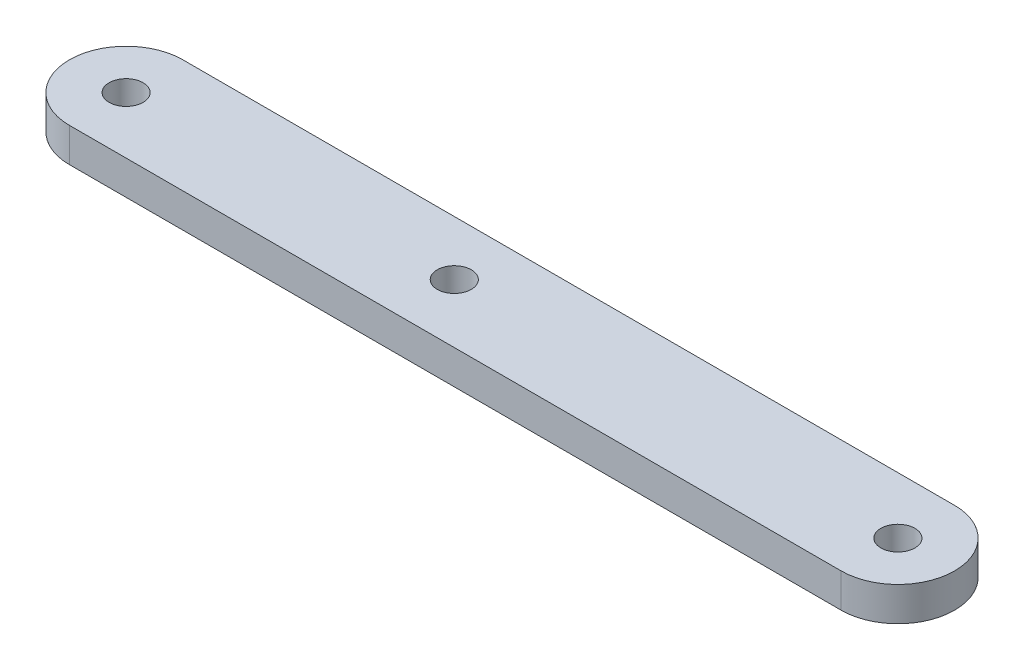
ISO-10303-21;
HEADER;
FILE_DESCRIPTION(('STEP AP214'),'2;1');
FILE_NAME('part.step','',(''),(''),'','','');
FILE_SCHEMA(('AUTOMOTIVE_DESIGN { 1 0 10303 214 1 1 1 1 }'));
ENDSEC;
DATA;
#1=APPLICATION_CONTEXT('core data for automotive mechanical design processes');
#2=APPLICATION_PROTOCOL_DEFINITION('international standard','automotive_design',2000,#1);
#3=PRODUCT_CONTEXT('',#1,'mechanical');
#4=PRODUCT('Part','Part','',(#3));
#5=PRODUCT_RELATED_PRODUCT_CATEGORY('part','',(#4));
#6=PRODUCT_DEFINITION_FORMATION('','',#4);
#7=PRODUCT_DEFINITION_CONTEXT('part definition',#1,'design');
#8=PRODUCT_DEFINITION('design','',#6,#7);
#9=PRODUCT_DEFINITION_SHAPE('','',#8);
#10=(LENGTH_UNIT() NAMED_UNIT(*) SI_UNIT(.MILLI.,.METRE.));
#11=(NAMED_UNIT(*) PLANE_ANGLE_UNIT() SI_UNIT($,.RADIAN.));
#12=(NAMED_UNIT(*) SI_UNIT($,.STERADIAN.) SOLID_ANGLE_UNIT());
#13=UNCERTAINTY_MEASURE_WITH_UNIT(LENGTH_MEASURE(1.E-05),#10,'distance_accuracy_value','');
#14=(GEOMETRIC_REPRESENTATION_CONTEXT(3) GLOBAL_UNCERTAINTY_ASSIGNED_CONTEXT((#13)) GLOBAL_UNIT_ASSIGNED_CONTEXT((#10,
#11,#12)) REPRESENTATION_CONTEXT('',''));
#15=CARTESIAN_POINT('',(0.,0.,0.));
#16=DIRECTION('',(0.,0.,1.));
#17=DIRECTION('',(1.,0.,0.));
#18=AXIS2_PLACEMENT_3D('',#15,#16,#17);
#19=CARTESIAN_POINT('',(0.,3.,5.));
#20=DIRECTION('',(0.,0.,-1.));
#21=DIRECTION('',(-1.,0.,0.));
#22=AXIS2_PLACEMENT_3D('',#19,#20,#21);
#23=PLANE('',#22);
#24=DIRECTION('',(1.,0.,0.));
#25=VECTOR('',#24,1.);
#26=CARTESIAN_POINT('',(0.,0.,5.));
#27=LINE('',#26,#25);
#28=CARTESIAN_POINT('',(-34.,0.,5.));
#29=VERTEX_POINT('',#28);
#30=CARTESIAN_POINT('',(34.,0.,5.));
#31=VERTEX_POINT('',#30);
#32=EDGE_CURVE('E103',#29,#31,#27,.T.);
#33=ORIENTED_EDGE('',*,*,#32,.T.);
#34=DIRECTION('',(0.,-1.,0.));
#35=VECTOR('',#34,1.);
#36=CARTESIAN_POINT('',(34.,3.,5.));
#37=LINE('',#36,#35);
#38=CARTESIAN_POINT('',(34.,3.,5.));
#39=VERTEX_POINT('',#38);
#40=EDGE_CURVE('E11',#39,#31,#37,.T.);
#41=ORIENTED_EDGE('',*,*,#40,.F.);
#42=DIRECTION('',(1.,0.,0.));
#43=VECTOR('',#42,1.);
#44=CARTESIAN_POINT('',(0.,3.,5.));
#45=LINE('',#44,#43);
#46=CARTESIAN_POINT('',(-34.,3.,5.));
#47=VERTEX_POINT('',#46);
#48=EDGE_CURVE('E81',#47,#39,#45,.T.);
#49=ORIENTED_EDGE('',*,*,#48,.F.);
#50=DIRECTION('',(0.,-1.,0.));
#51=VECTOR('',#50,1.);
#52=CARTESIAN_POINT('',(-34.,3.,5.));
#53=LINE('',#52,#51);
#54=EDGE_CURVE('E92',#47,#29,#53,.T.);
#55=ORIENTED_EDGE('',*,*,#54,.T.);
#56=EDGE_LOOP('',(#33,#41,#49,#55));
#57=FACE_BOUND('',#56,.T.);
#58=ADVANCED_FACE('F33',(#57),#23,.F.);
#59=CARTESIAN_POINT('',(34.,3.,0.));
#60=DIRECTION('',(0.,-1.,0.));
#61=DIRECTION('',(0.,0.,-1.));
#62=AXIS2_PLACEMENT_3D('',#59,#60,#61);
#63=CYLINDRICAL_SURFACE('',#62,5.);
#64=CARTESIAN_POINT('',(34.,0.,0.));
#65=DIRECTION('',(0.,1.,0.));
#66=DIRECTION('',(0.,0.,1.));
#67=AXIS2_PLACEMENT_3D('',#64,#65,#66);
#68=CIRCLE('',#67,5.);
#69=CARTESIAN_POINT('',(34.,0.,-5.));
#70=VERTEX_POINT('',#69);
#71=EDGE_CURVE('E86',#31,#70,#68,.T.);
#72=ORIENTED_EDGE('',*,*,#71,.T.);
#73=DIRECTION('',(0.,-1.,0.));
#74=VECTOR('',#73,1.);
#75=CARTESIAN_POINT('',(34.,3.,-5.));
#76=LINE('',#75,#74);
#77=CARTESIAN_POINT('',(34.,3.,-5.));
#78=VERTEX_POINT('',#77);
#79=EDGE_CURVE('E42',#78,#70,#76,.T.);
#80=ORIENTED_EDGE('',*,*,#79,.F.);
#81=CARTESIAN_POINT('',(34.,3.,0.));
#82=DIRECTION('',(0.,1.,0.));
#83=DIRECTION('',(0.,0.,1.));
#84=AXIS2_PLACEMENT_3D('',#81,#82,#83);
#85=CIRCLE('',#84,5.);
#86=EDGE_CURVE('E76',#39,#78,#85,.T.);
#87=ORIENTED_EDGE('',*,*,#86,.F.);
#88=ORIENTED_EDGE('',*,*,#40,.T.);
#89=EDGE_LOOP('',(#72,#80,#87,#88));
#90=FACE_BOUND('',#89,.T.);
#91=ADVANCED_FACE('F85',(#90),#63,.T.);
#92=CARTESIAN_POINT('',(0.,3.,-5.));
#93=DIRECTION('',(0.,0.,-1.));
#94=DIRECTION('',(-1.,0.,0.));
#95=AXIS2_PLACEMENT_3D('',#92,#93,#94);
#96=PLANE('',#95);
#97=DIRECTION('',(1.,0.,0.));
#98=VECTOR('',#97,1.);
#99=CARTESIAN_POINT('',(0.,0.,-5.));
#100=LINE('',#99,#98);
#101=CARTESIAN_POINT('',(-34.,0.,-5.));
#102=VERTEX_POINT('',#101);
#103=EDGE_CURVE('E107',#102,#70,#100,.T.);
#104=ORIENTED_EDGE('',*,*,#103,.F.);
#105=DIRECTION('',(0.,-1.,0.));
#106=VECTOR('',#105,1.);
#107=CARTESIAN_POINT('',(-34.,3.,-5.));
#108=LINE('',#107,#106);
#109=CARTESIAN_POINT('',(-34.,3.,-5.));
#110=VERTEX_POINT('',#109);
#111=EDGE_CURVE('E66',#110,#102,#108,.T.);
#112=ORIENTED_EDGE('',*,*,#111,.F.);
#113=DIRECTION('',(1.,0.,0.));
#114=VECTOR('',#113,1.);
#115=CARTESIAN_POINT('',(0.,3.,-5.));
#116=LINE('',#115,#114);
#117=EDGE_CURVE('E79',#110,#78,#116,.T.);
#118=ORIENTED_EDGE('',*,*,#117,.T.);
#119=ORIENTED_EDGE('',*,*,#79,.T.);
#120=EDGE_LOOP('',(#104,#112,#118,#119));
#121=FACE_BOUND('',#120,.T.);
#122=ADVANCED_FACE('F90',(#121),#96,.T.);
#123=CARTESIAN_POINT('',(-34.,3.,0.));
#124=DIRECTION('',(0.,-1.,0.));
#125=DIRECTION('',(0.,0.,-1.));
#126=AXIS2_PLACEMENT_3D('',#123,#124,#125);
#127=CYLINDRICAL_SURFACE('',#126,1.5);
#128=CARTESIAN_POINT('',(-34.,3.,0.));
#129=DIRECTION('',(0.,1.,0.));
#130=DIRECTION('',(0.,0.,1.));
#131=AXIS2_PLACEMENT_3D('',#128,#129,#130);
#132=CIRCLE('',#131,1.5);
#133=CARTESIAN_POINT('',(-34.,3.,1.5));
#134=VERTEX_POINT('',#133);
#135=EDGE_CURVE('E151',#134,#134,#132,.T.);
#136=ORIENTED_EDGE('',*,*,#135,.T.);
#137=EDGE_LOOP('',(#136));
#138=FACE_BOUND('',#137,.T.);
#139=CARTESIAN_POINT('',(-34.,0.,0.));
#140=DIRECTION('',(0.,1.,0.));
#141=DIRECTION('',(0.,0.,1.));
#142=AXIS2_PLACEMENT_3D('',#139,#140,#141);
#143=CIRCLE('',#142,1.5);
#144=CARTESIAN_POINT('',(-34.,0.,1.5));
#145=VERTEX_POINT('',#144);
#146=EDGE_CURVE('E99',#145,#145,#143,.T.);
#147=ORIENTED_EDGE('',*,*,#146,.F.);
#148=EDGE_LOOP('',(#147));
#149=FACE_BOUND('',#148,.T.);
#150=ADVANCED_FACE('F140',(#138,#149),#127,.F.);
#151=CARTESIAN_POINT('',(34.,3.,0.));
#152=DIRECTION('',(0.,-1.,0.));
#153=DIRECTION('',(0.,0.,-1.));
#154=AXIS2_PLACEMENT_3D('',#151,#152,#153);
#155=CYLINDRICAL_SURFACE('',#154,1.5);
#156=CARTESIAN_POINT('',(34.,3.,0.));
#157=DIRECTION('',(0.,1.,0.));
#158=DIRECTION('',(0.,0.,1.));
#159=AXIS2_PLACEMENT_3D('',#156,#157,#158);
#160=CIRCLE('',#159,1.5);
#161=CARTESIAN_POINT('',(34.,3.,1.5));
#162=VERTEX_POINT('',#161);
#163=EDGE_CURVE('E110',#162,#162,#160,.T.);
#164=ORIENTED_EDGE('',*,*,#163,.T.);
#165=EDGE_LOOP('',(#164));
#166=FACE_BOUND('',#165,.T.);
#167=CARTESIAN_POINT('',(34.,0.,0.));
#168=DIRECTION('',(0.,1.,0.));
#169=DIRECTION('',(0.,0.,1.));
#170=AXIS2_PLACEMENT_3D('',#167,#168,#169);
#171=CIRCLE('',#170,1.5);
#172=CARTESIAN_POINT('',(34.,0.,1.5));
#173=VERTEX_POINT('',#172);
#174=EDGE_CURVE('E96',#173,#173,#171,.T.);
#175=ORIENTED_EDGE('',*,*,#174,.F.);
#176=EDGE_LOOP('',(#175));
#177=FACE_BOUND('',#176,.T.);
#178=ADVANCED_FACE('F35',(#166,#177),#155,.F.);
#179=CARTESIAN_POINT('',(-34.,3.,0.));
#180=DIRECTION('',(0.,-1.,0.));
#181=DIRECTION('',(0.,0.,-1.));
#182=AXIS2_PLACEMENT_3D('',#179,#180,#181);
#183=CYLINDRICAL_SURFACE('',#182,5.);
#184=CARTESIAN_POINT('',(-34.,0.,0.));
#185=DIRECTION('',(0.,1.,0.));
#186=DIRECTION('',(0.,0.,1.));
#187=AXIS2_PLACEMENT_3D('',#184,#185,#186);
#188=CIRCLE('',#187,5.);
#189=EDGE_CURVE('E69',#102,#29,#188,.T.);
#190=ORIENTED_EDGE('',*,*,#189,.T.);
#191=ORIENTED_EDGE('',*,*,#54,.F.);
#192=CARTESIAN_POINT('',(-34.,3.,0.));
#193=DIRECTION('',(0.,1.,0.));
#194=DIRECTION('',(0.,0.,1.));
#195=AXIS2_PLACEMENT_3D('',#192,#193,#194);
#196=CIRCLE('',#195,5.);
#197=EDGE_CURVE('E50',#110,#47,#196,.T.);
#198=ORIENTED_EDGE('',*,*,#197,.F.);
#199=ORIENTED_EDGE('',*,*,#111,.T.);
#200=EDGE_LOOP('',(#190,#191,#198,#199));
#201=FACE_BOUND('',#200,.T.);
#202=ADVANCED_FACE('F127',(#201),#183,.T.);
#203=CARTESIAN_POINT('',(0.,3.,0.));
#204=DIRECTION('',(0.,1.,0.));
#205=DIRECTION('',(0.,0.,1.));
#206=AXIS2_PLACEMENT_3D('',#203,#204,#205);
#207=PLANE('',#206);
#208=CARTESIAN_POINT('',(-5.27134970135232,3.,-0.184873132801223));
#209=DIRECTION('',(0.,-1.,0.));
#210=DIRECTION('',(0.,0.,-1.));
#211=AXIS2_PLACEMENT_3D('',#208,#209,#210);
#212=CIRCLE('',#211,1.5);
#213=CARTESIAN_POINT('',(-5.27134970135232,3.,-1.68487313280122));
#214=VERTEX_POINT('',#213);
#215=EDGE_CURVE('E100',#214,#214,#212,.T.);
#216=ORIENTED_EDGE('',*,*,#215,.T.);
#217=EDGE_LOOP('',(#216));
#218=FACE_BOUND('',#217,.T.);
#219=ORIENTED_EDGE('',*,*,#163,.F.);
#220=EDGE_LOOP('',(#219));
#221=FACE_BOUND('',#220,.T.);
#222=ORIENTED_EDGE('',*,*,#135,.F.);
#223=EDGE_LOOP('',(#222));
#224=FACE_BOUND('',#223,.T.);
#225=ORIENTED_EDGE('',*,*,#48,.T.);
#226=ORIENTED_EDGE('',*,*,#86,.T.);
#227=ORIENTED_EDGE('',*,*,#117,.F.);
#228=ORIENTED_EDGE('',*,*,#197,.T.);
#229=EDGE_LOOP('',(#225,#226,#227,#228));
#230=FACE_BOUND('',#229,.T.);
#231=ADVANCED_FACE('F77',(#218,#221,#224,#230),#207,.T.);
#232=CARTESIAN_POINT('',(0.,0.,0.));
#233=DIRECTION('',(0.,1.,0.));
#234=DIRECTION('',(0.,0.,1.));
#235=AXIS2_PLACEMENT_3D('',#232,#233,#234);
#236=PLANE('',#235);
#237=CARTESIAN_POINT('',(-5.27134970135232,0.,-0.184873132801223));
#238=DIRECTION('',(0.,-1.,0.));
#239=DIRECTION('',(0.,0.,-1.));
#240=AXIS2_PLACEMENT_3D('',#237,#238,#239);
#241=CIRCLE('',#240,1.5);
#242=CARTESIAN_POINT('',(-5.27134970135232,0.,-1.68487313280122));
#243=VERTEX_POINT('',#242);
#244=EDGE_CURVE('E159',#243,#243,#241,.T.);
#245=ORIENTED_EDGE('',*,*,#244,.F.);
#246=EDGE_LOOP('',(#245));
#247=FACE_BOUND('',#246,.T.);
#248=ORIENTED_EDGE('',*,*,#174,.T.);
#249=EDGE_LOOP('',(#248));
#250=FACE_BOUND('',#249,.T.);
#251=ORIENTED_EDGE('',*,*,#146,.T.);
#252=EDGE_LOOP('',(#251));
#253=FACE_BOUND('',#252,.T.);
#254=ORIENTED_EDGE('',*,*,#32,.F.);
#255=ORIENTED_EDGE('',*,*,#189,.F.);
#256=ORIENTED_EDGE('',*,*,#103,.T.);
#257=ORIENTED_EDGE('',*,*,#71,.F.);
#258=EDGE_LOOP('',(#254,#255,#256,#257));
#259=FACE_BOUND('',#258,.T.);
#260=ADVANCED_FACE('F115',(#247,#250,#253,#259),#236,.F.);
#261=CARTESIAN_POINT('',(-5.27134970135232,3.,-0.184873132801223));
#262=DIRECTION('',(0.,-1.,0.));
#263=DIRECTION('',(0.,0.,-1.));
#264=AXIS2_PLACEMENT_3D('',#261,#262,#263);
#265=CYLINDRICAL_SURFACE('',#264,1.5);
#266=ORIENTED_EDGE('',*,*,#215,.F.);
#267=EDGE_LOOP('',(#266));
#268=FACE_BOUND('',#267,.T.);
#269=ORIENTED_EDGE('',*,*,#244,.T.);
#270=EDGE_LOOP('',(#269));
#271=FACE_BOUND('',#270,.T.);
#272=ADVANCED_FACE('F117',(#268,#271),#265,.F.);
#273=CLOSED_SHELL('',(#58,#91,#122,#150,#178,#202,#231,#260,#272));
#274=MANIFOLD_SOLID_BREP('B2',#273);
#275=ADVANCED_BREP_SHAPE_REPRESENTATION('',(#18,#274),#14);
#276=SHAPE_DEFINITION_REPRESENTATION(#9,#275);
ENDSEC;
END-ISO-10303-21;
